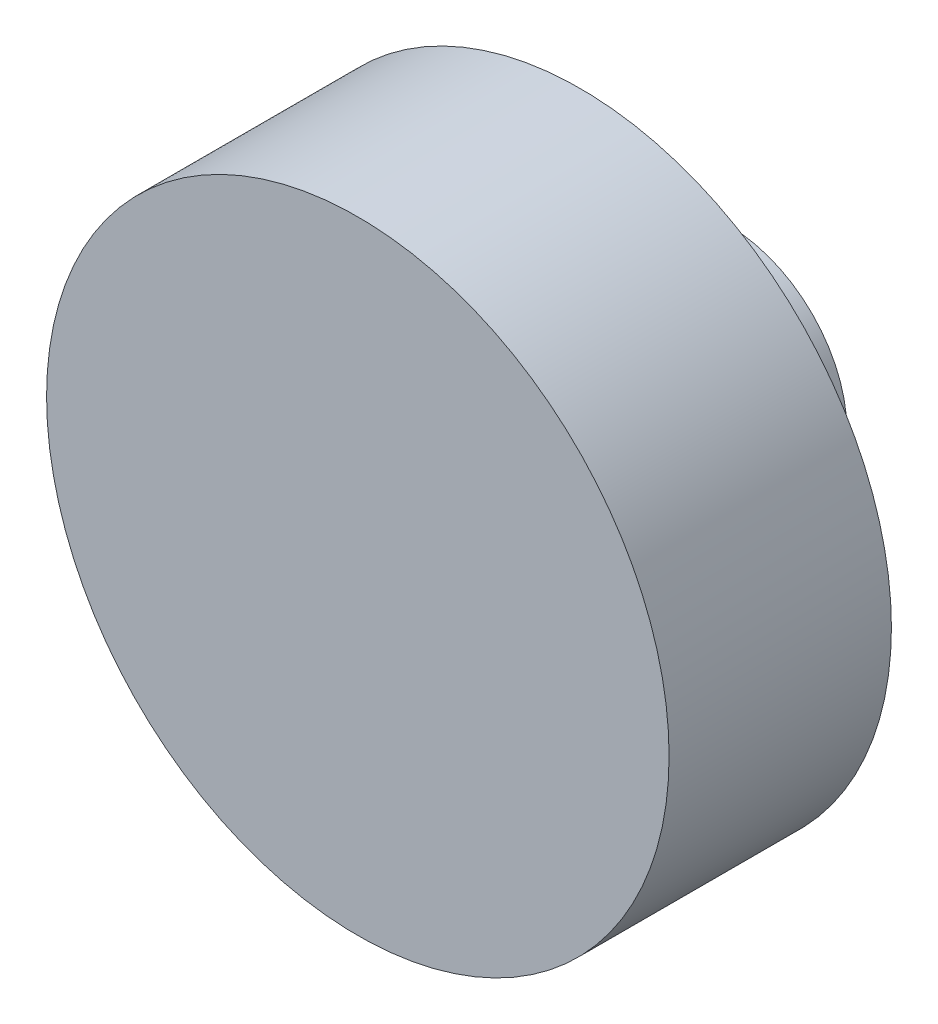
from build123d import *

# Parameters (mm, degrees)
SKETCH1_R      = 8
EXTRUDE1_DEPTH = 10
SKETCH2_R      = 21
EXTRUDE2_DEPTH = 15


with BuildPart() as part:
    # Sketch1 → Extrude1 (new body)
    with BuildSketch(Plane.XY):
        with Locations((-74.780787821, 0)):
            Circle(SKETCH1_R)
    extrude(amount=EXTRUDE1_DEPTH)

    # Sketch2 → Extrude2 (add)
    with BuildSketch(Plane.XY.offset(10)):
        with Locations((-74.780787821, 0)):
            Circle(SKETCH2_R)
    extrude(amount=EXTRUDE2_DEPTH)


solid = part.part
